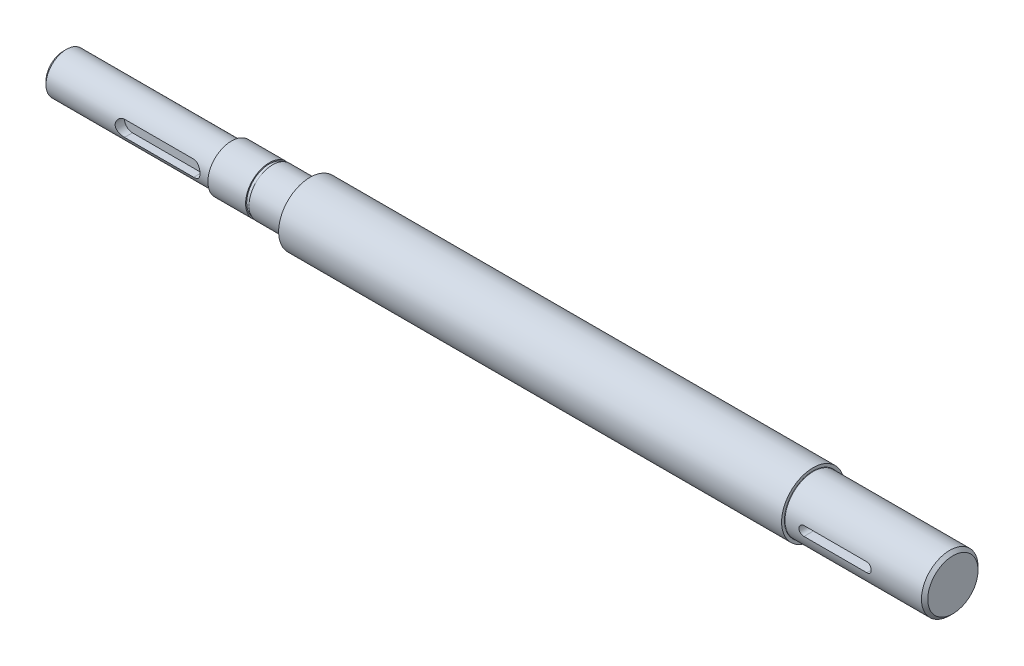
ISO-10303-21;
HEADER;
FILE_DESCRIPTION(('STEP AP214'),'2;1');
FILE_NAME('part.step','',(''),(''),'','','');
FILE_SCHEMA(('AUTOMOTIVE_DESIGN { 1 0 10303 214 1 1 1 1 }'));
ENDSEC;
DATA;
#1=APPLICATION_CONTEXT('core data for automotive mechanical design processes');
#2=APPLICATION_PROTOCOL_DEFINITION('international standard','automotive_design',2000,#1);
#3=PRODUCT_CONTEXT('',#1,'mechanical');
#4=PRODUCT('Part','Part','',(#3));
#5=PRODUCT_RELATED_PRODUCT_CATEGORY('part','',(#4));
#6=PRODUCT_DEFINITION_FORMATION('','',#4);
#7=PRODUCT_DEFINITION_CONTEXT('part definition',#1,'design');
#8=PRODUCT_DEFINITION('design','',#6,#7);
#9=PRODUCT_DEFINITION_SHAPE('','',#8);
#10=(LENGTH_UNIT() NAMED_UNIT(*) SI_UNIT(.MILLI.,.METRE.));
#11=(NAMED_UNIT(*) PLANE_ANGLE_UNIT() SI_UNIT($,.RADIAN.));
#12=(NAMED_UNIT(*) SI_UNIT($,.STERADIAN.) SOLID_ANGLE_UNIT());
#13=UNCERTAINTY_MEASURE_WITH_UNIT(LENGTH_MEASURE(1.E-05),#10,'distance_accuracy_value','');
#14=(GEOMETRIC_REPRESENTATION_CONTEXT(3) GLOBAL_UNCERTAINTY_ASSIGNED_CONTEXT((#13)) GLOBAL_UNIT_ASSIGNED_CONTEXT((#10,
#11,#12)) REPRESENTATION_CONTEXT('',''));
#15=CARTESIAN_POINT('',(0.,0.,0.));
#16=DIRECTION('',(0.,0.,1.));
#17=DIRECTION('',(1.,0.,0.));
#18=AXIS2_PLACEMENT_3D('',#15,#16,#17);
#19=CARTESIAN_POINT('',(0.,0.,0.));
#20=DIRECTION('',(1.,0.,0.));
#21=DIRECTION('',(0.,0.,-1.));
#22=AXIS2_PLACEMENT_3D('',#19,#20,#21);
#23=PLANE('',#22);
#24=CARTESIAN_POINT('',(0.,0.,0.));
#25=DIRECTION('',(1.,0.,0.));
#26=DIRECTION('',(0.,0.,-1.));
#27=AXIS2_PLACEMENT_3D('',#24,#25,#26);
#28=CIRCLE('',#27,5.50000000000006);
#29=CARTESIAN_POINT('',(0.,0.,-5.50000000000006));
#30=VERTEX_POINT('',#29);
#31=EDGE_CURVE('E436',#30,#30,#28,.F.);
#32=ORIENTED_EDGE('',*,*,#31,.T.);
#33=EDGE_LOOP('',(#32));
#34=FACE_BOUND('',#33,.T.);
#35=ADVANCED_FACE('F34',(#34),#23,.F.);
#36=CARTESIAN_POINT('',(0.,0.,0.));
#37=DIRECTION('',(-1.,0.,0.));
#38=DIRECTION('',(0.,0.,1.));
#39=AXIS2_PLACEMENT_3D('',#36,#37,#38);
#40=CYLINDRICAL_SURFACE('',#39,6.5);
#41=CARTESIAN_POINT('',(53.4,0.,0.));
#42=DIRECTION('',(1.,0.,0.));
#43=DIRECTION('',(0.,0.,-1.));
#44=AXIS2_PLACEMENT_3D('',#41,#42,#43);
#45=CIRCLE('',#44,6.5);
#46=CARTESIAN_POINT('',(53.4,0.,-6.5));
#47=VERTEX_POINT('',#46);
#48=EDGE_CURVE('E42',#47,#47,#45,.F.);
#49=ORIENTED_EDGE('',*,*,#48,.T.);
#50=EDGE_LOOP('',(#49));
#51=FACE_BOUND('',#50,.T.);
#52=CARTESIAN_POINT('',(0.999999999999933,0.,0.));
#53=DIRECTION('',(1.,0.,0.));
#54=DIRECTION('',(0.,0.,-1.));
#55=AXIS2_PLACEMENT_3D('',#52,#53,#54);
#56=CIRCLE('',#55,6.5);
#57=CARTESIAN_POINT('',(0.999999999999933,0.,-6.5));
#58=VERTEX_POINT('',#57);
#59=EDGE_CURVE('E296',#58,#58,#56,.T.);
#60=ORIENTED_EDGE('',*,*,#59,.T.);
#61=EDGE_LOOP('',(#60));
#62=FACE_BOUND('',#61,.T.);
#63=DIRECTION('',(-1.,0.,0.));
#64=VECTOR('',#63,1.);
#65=CARTESIAN_POINT('',(0.,-2.5,6.));
#66=LINE('',#65,#64);
#67=CARTESIAN_POINT('',(47.5,-2.5,6.));
#68=VERTEX_POINT('',#67);
#69=CARTESIAN_POINT('',(25.5,-2.5,6.));
#70=VERTEX_POINT('',#69);
#71=EDGE_CURVE('E179',#68,#70,#66,.T.);
#72=ORIENTED_EDGE('',*,*,#71,.T.);
#73=CARTESIAN_POINT('',(25.5,-2.5,6.));
#74=CARTESIAN_POINT('',(25.4325068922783,-2.5000097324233,5.99998690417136));
#75=CARTESIAN_POINT('',(25.3650209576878,-2.49726705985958,6.00113851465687));
#76=CARTESIAN_POINT('',(25.2305881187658,-2.48635290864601,6.00567338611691));
#77=CARTESIAN_POINT('',(25.1636410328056,-2.47818334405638,6.0090558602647));
#78=CARTESIAN_POINT('',(25.0310073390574,-2.45653131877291,6.01793841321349));
#79=CARTESIAN_POINT('',(24.965316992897,-2.44306856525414,6.02343063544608));
#80=CARTESIAN_POINT('',(24.8354200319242,-2.41097802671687,6.03634679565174));
#81=CARTESIAN_POINT('',(24.7712134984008,-2.39234995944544,6.04377083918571));
#82=CARTESIAN_POINT('',(24.5815925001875,-2.32899932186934,6.06859455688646));
#83=CARTESIAN_POINT('',(24.4589297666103,-2.27676942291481,6.08856367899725));
#84=CARTESIAN_POINT('',(24.2240633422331,-2.15397308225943,6.13307781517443));
#85=CARTESIAN_POINT('',(24.1118688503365,-2.08339071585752,6.15762679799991));
#86=CARTESIAN_POINT('',(23.8952626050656,-1.92195266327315,6.20996142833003));
#87=CARTESIAN_POINT('',(23.7914706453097,-1.83029547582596,6.23784527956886));
#88=CARTESIAN_POINT('',(23.6002963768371,-1.63101277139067,6.29289074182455));
#89=CARTESIAN_POINT('',(23.5129173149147,-1.52338410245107,6.32005220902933));
#90=CARTESIAN_POINT('',(23.3539853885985,-1.29042661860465,6.37177529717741));
#91=CARTESIAN_POINT('',(23.2831174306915,-1.16459922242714,6.39620772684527));
#92=CARTESIAN_POINT('',(23.1638189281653,-0.90170460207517,6.43852594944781));
#93=CARTESIAN_POINT('',(23.1153796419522,-0.764641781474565,6.45641429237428));
#94=CARTESIAN_POINT('',(23.0445173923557,-0.489729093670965,6.48292860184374));
#95=CARTESIAN_POINT('',(23.0210187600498,-0.352194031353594,6.49193621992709));
#96=CARTESIAN_POINT('',(22.9972517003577,-0.0748549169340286,6.50104762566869));
#97=CARTESIAN_POINT('',(22.9969757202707,0.0649483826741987,6.50115430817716));
#98=CARTESIAN_POINT('',(23.0190501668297,0.335117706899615,6.49269024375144));
#99=CARTESIAN_POINT('',(23.0402247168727,0.46559643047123,6.48457045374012));
#100=CARTESIAN_POINT('',(23.1026123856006,0.720982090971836,6.46116364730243));
#101=CARTESIAN_POINT('',(23.1438266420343,0.845888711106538,6.4458762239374));
#102=CARTESIAN_POINT('',(23.2456375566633,1.08878530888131,6.4093577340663));
#103=CARTESIAN_POINT('',(23.3065118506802,1.20664567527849,6.38804210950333));
#104=CARTESIAN_POINT('',(23.4456647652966,1.43077664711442,6.34160845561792));
#105=CARTESIAN_POINT('',(23.523949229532,1.5370433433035,6.31648915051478));
#106=CARTESIAN_POINT('',(23.7012897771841,1.74186560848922,6.26320862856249));
#107=CARTESIAN_POINT('',(23.8013234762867,1.83955197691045,6.23495532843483));
#108=CARTESIAN_POINT('',(24.016520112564,2.01711505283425,6.17979877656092));
#109=CARTESIAN_POINT('',(24.1316892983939,2.09698436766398,6.15289608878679));
#110=CARTESIAN_POINT('',(24.3775178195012,2.23844676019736,6.102879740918));
#111=CARTESIAN_POINT('',(24.5084915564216,2.29953500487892,6.07987716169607));
#112=CARTESIAN_POINT('',(24.7799191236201,2.39838605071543,6.04157232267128));
#113=CARTESIAN_POINT('',(24.92035626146,2.43618878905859,6.02625688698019));
#114=CARTESIAN_POINT('',(25.1351897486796,2.4743245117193,6.01064806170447));
#115=CARTESIAN_POINT('',(25.207784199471,2.48394241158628,6.00667159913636));
#116=CARTESIAN_POINT('',(25.3535711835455,2.49677951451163,6.00134277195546));
#117=CARTESIAN_POINT('',(25.4267631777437,2.50000395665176,5.99998825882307));
#118=CARTESIAN_POINT('',(25.5,2.5,6.));
#119=B_SPLINE_CURVE_WITH_KNOTS('',3,(#73,#74,#75,#76,#77,#78,#79,#80,#81,#82,#83,#84,#85,#86,
#87,#88,#89,#90,#91,#92,#93,#94,#95,#96,#97,#98,#99,#100,#101,#102,#103,#104,#105,#106,#107,
#108,#109,#110,#111,#112,#113,#114,#115,#116,#117,#118),.UNSPECIFIED.,.F.,.F.,(4,2,2,2,2,2,2,2,
2,2,2,2,2,2,2,2,2,2,2,2,2,2,4),(0.,0.202401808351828,0.404732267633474,0.606316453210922,
0.807911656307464,1.21035890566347,1.61315653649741,2.0350209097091,2.45696864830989,
2.89414312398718,3.33114706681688,3.74842479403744,4.16556680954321,4.56101652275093,
4.95648869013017,5.35780957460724,5.75926536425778,6.18527598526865,6.6114630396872,
7.04826665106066,7.48431899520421,7.70403971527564,7.92358031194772),.UNSPECIFIED.);
#120=CARTESIAN_POINT('',(25.5,2.5,6.));
#121=VERTEX_POINT('',#120);
#122=EDGE_CURVE('E215',#70,#121,#119,.T.);
#123=ORIENTED_EDGE('',*,*,#122,.T.);
#124=DIRECTION('',(-1.,0.,0.));
#125=VECTOR('',#124,1.);
#126=CARTESIAN_POINT('',(0.,2.5,6.));
#127=LINE('',#126,#125);
#128=CARTESIAN_POINT('',(47.5,2.5,6.));
#129=VERTEX_POINT('',#128);
#130=EDGE_CURVE('E190',#121,#129,#127,.F.);
#131=ORIENTED_EDGE('',*,*,#130,.T.);
#132=CARTESIAN_POINT('',(47.5,2.5,6.));
#133=CARTESIAN_POINT('',(47.5674931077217,2.5000097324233,5.99998690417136));
#134=CARTESIAN_POINT('',(47.6349790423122,2.49726705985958,6.00113851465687));
#135=CARTESIAN_POINT('',(47.7694118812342,2.48635290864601,6.00567338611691));
#136=CARTESIAN_POINT('',(47.8363589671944,2.47818334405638,6.0090558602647));
#137=CARTESIAN_POINT('',(47.9689926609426,2.45653131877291,6.01793841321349));
#138=CARTESIAN_POINT('',(48.034683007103,2.44306856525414,6.02343063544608));
#139=CARTESIAN_POINT('',(48.1645799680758,2.41097802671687,6.03634679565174));
#140=CARTESIAN_POINT('',(48.2287865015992,2.39234995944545,6.04377083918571));
#141=CARTESIAN_POINT('',(48.4184074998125,2.32899932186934,6.06859455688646));
#142=CARTESIAN_POINT('',(48.5410702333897,2.27676942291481,6.08856367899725));
#143=CARTESIAN_POINT('',(48.7759366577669,2.15397308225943,6.13307781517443));
#144=CARTESIAN_POINT('',(48.8881311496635,2.08339071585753,6.15762679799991));
#145=CARTESIAN_POINT('',(49.1047373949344,1.92195266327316,6.20996142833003));
#146=CARTESIAN_POINT('',(49.2085293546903,1.83029547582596,6.23784527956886));
#147=CARTESIAN_POINT('',(49.3997036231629,1.63101277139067,6.29289074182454));
#148=CARTESIAN_POINT('',(49.4870826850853,1.52338410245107,6.32005220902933));
#149=CARTESIAN_POINT('',(49.6460146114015,1.29042661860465,6.37177529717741));
#150=CARTESIAN_POINT('',(49.7168825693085,1.16459922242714,6.39620772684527));
#151=CARTESIAN_POINT('',(49.8361810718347,0.901704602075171,6.43852594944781));
#152=CARTESIAN_POINT('',(49.8846203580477,0.764641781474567,6.45641429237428));
#153=CARTESIAN_POINT('',(49.9554826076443,0.489729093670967,6.48292860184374));
#154=CARTESIAN_POINT('',(49.9789812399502,0.352194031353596,6.49193621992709));
#155=CARTESIAN_POINT('',(50.0027482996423,0.0748549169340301,6.50104762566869));
#156=CARTESIAN_POINT('',(50.0030242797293,-0.0649483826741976,6.50115430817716));
#157=CARTESIAN_POINT('',(49.9809498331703,-0.335117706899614,6.49269024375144));
#158=CARTESIAN_POINT('',(49.9597752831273,-0.465596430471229,6.48457045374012));
#159=CARTESIAN_POINT('',(49.8973876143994,-0.720982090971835,6.46116364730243));
#160=CARTESIAN_POINT('',(49.8561733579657,-0.845888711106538,6.4458762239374));
#161=CARTESIAN_POINT('',(49.7543624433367,-1.08878530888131,6.4093577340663));
#162=CARTESIAN_POINT('',(49.6934881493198,-1.20664567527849,6.38804210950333));
#163=CARTESIAN_POINT('',(49.5543352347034,-1.43077664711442,6.34160845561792));
#164=CARTESIAN_POINT('',(49.476050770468,-1.5370433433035,6.31648915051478));
#165=CARTESIAN_POINT('',(49.2987102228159,-1.74186560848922,6.26320862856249));
#166=CARTESIAN_POINT('',(49.1986765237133,-1.83955197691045,6.23495532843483));
#167=CARTESIAN_POINT('',(48.983479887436,-2.01711505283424,6.17979877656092));
#168=CARTESIAN_POINT('',(48.8683107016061,-2.09698436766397,6.15289608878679));
#169=CARTESIAN_POINT('',(48.6224821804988,-2.23844676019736,6.102879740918));
#170=CARTESIAN_POINT('',(48.4915084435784,-2.29953500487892,6.07987716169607));
#171=CARTESIAN_POINT('',(48.22008087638,-2.39838605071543,6.04157232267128));
#172=CARTESIAN_POINT('',(48.07964373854,-2.43618878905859,6.02625688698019));
#173=CARTESIAN_POINT('',(47.8648102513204,-2.4743245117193,6.01064806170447));
#174=CARTESIAN_POINT('',(47.792215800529,-2.48394241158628,6.00667159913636));
#175=CARTESIAN_POINT('',(47.6464288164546,-2.49677951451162,6.00134277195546));
#176=CARTESIAN_POINT('',(47.5732368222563,-2.50000395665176,5.99998825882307));
#177=CARTESIAN_POINT('',(47.5,-2.5,6.));
#178=B_SPLINE_CURVE_WITH_KNOTS('',3,(#132,#133,#134,#135,#136,#137,#138,#139,#140,#141,#142,
#143,#144,#145,#146,#147,#148,#149,#150,#151,#152,#153,#154,#155,#156,#157,#158,#159,#160,#161,
#162,#163,#164,#165,#166,#167,#168,#169,#170,#171,#172,#173,#174,#175,#176,#177),.UNSPECIFIED.,
.F.,.F.,(4,2,2,2,2,2,2,2,2,2,2,2,2,2,2,2,2,2,2,2,2,2,4),(0.,0.202401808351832,0.404732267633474,
0.606316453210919,0.807911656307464,1.21035890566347,1.61315653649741,2.0350209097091,
2.45696864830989,2.89414312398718,3.33114706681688,3.74842479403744,4.16556680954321,
4.56101652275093,4.95648869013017,5.35780957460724,5.75926536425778,6.18527598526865,
6.61146303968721,7.04826665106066,7.4843189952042,7.70403971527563,7.92358031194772),.UNSPECIFIED.);
#179=EDGE_CURVE('E182',#129,#68,#178,.T.);
#180=ORIENTED_EDGE('',*,*,#179,.T.);
#181=EDGE_LOOP('',(#72,#123,#131,#180));
#182=FACE_BOUND('',#181,.T.);
#183=ADVANCED_FACE('F192',(#51,#62,#182),#40,.T.);
#184=CARTESIAN_POINT('',(53.5,6.5,0.));
#185=DIRECTION('',(1.,0.,0.));
#186=DIRECTION('',(0.,0.,-1.));
#187=AXIS2_PLACEMENT_3D('',#184,#185,#186);
#188=PLANE('',#187);
#189=CARTESIAN_POINT('',(53.5,0.,0.));
#190=DIRECTION('',(1.,0.,0.));
#191=DIRECTION('',(0.,0.,-1.));
#192=AXIS2_PLACEMENT_3D('',#189,#190,#191);
#193=CIRCLE('',#192,6.6);
#194=CARTESIAN_POINT('',(53.5,0.,-6.6));
#195=VERTEX_POINT('',#194);
#196=EDGE_CURVE('E11',#195,#195,#193,.T.);
#197=ORIENTED_EDGE('',*,*,#196,.T.);
#198=EDGE_LOOP('',(#197));
#199=FACE_BOUND('',#198,.T.);
#200=CARTESIAN_POINT('',(53.5,0.,0.));
#201=DIRECTION('',(-1.,0.,0.));
#202=DIRECTION('',(0.,0.,1.));
#203=AXIS2_PLACEMENT_3D('',#200,#201,#202);
#204=CIRCLE('',#203,7.5);
#205=CARTESIAN_POINT('',(53.5,0.,7.5));
#206=VERTEX_POINT('',#205);
#207=EDGE_CURVE('E176',#206,#206,#204,.T.);
#208=ORIENTED_EDGE('',*,*,#207,.T.);
#209=EDGE_LOOP('',(#208));
#210=FACE_BOUND('',#209,.T.);
#211=ADVANCED_FACE('F256',(#199,#210),#188,.F.);
#212=CARTESIAN_POINT('',(0.,0.,0.));
#213=DIRECTION('',(-1.,0.,0.));
#214=DIRECTION('',(0.,0.,1.));
#215=AXIS2_PLACEMENT_3D('',#212,#213,#214);
#216=CYLINDRICAL_SURFACE('',#215,7.5);
#217=ORIENTED_EDGE('',*,*,#207,.F.);
#218=EDGE_LOOP('',(#217));
#219=FACE_BOUND('',#218,.T.);
#220=CARTESIAN_POINT('',(65.5,0.,0.));
#221=DIRECTION('',(-1.,0.,0.));
#222=DIRECTION('',(0.,0.,1.));
#223=AXIS2_PLACEMENT_3D('',#220,#221,#222);
#224=CIRCLE('',#223,7.5);
#225=CARTESIAN_POINT('',(65.5,0.,7.5));
#226=VERTEX_POINT('',#225);
#227=EDGE_CURVE('E173',#226,#226,#224,.T.);
#228=ORIENTED_EDGE('',*,*,#227,.T.);
#229=EDGE_LOOP('',(#228));
#230=FACE_BOUND('',#229,.T.);
#231=ADVANCED_FACE('F397',(#219,#230),#216,.T.);
#232=CARTESIAN_POINT('',(65.5,7.5,0.));
#233=DIRECTION('',(-1.,0.,0.));
#234=DIRECTION('',(0.,0.,1.));
#235=AXIS2_PLACEMENT_3D('',#232,#233,#234);
#236=PLANE('',#235);
#237=ORIENTED_EDGE('',*,*,#227,.F.);
#238=EDGE_LOOP('',(#237));
#239=FACE_BOUND('',#238,.T.);
#240=CARTESIAN_POINT('',(65.5,0.,0.));
#241=DIRECTION('',(-1.,0.,0.));
#242=DIRECTION('',(0.,0.,1.));
#243=AXIS2_PLACEMENT_3D('',#240,#241,#242);
#244=CIRCLE('',#243,7.15);
#245=CARTESIAN_POINT('',(65.5,0.,7.15));
#246=VERTEX_POINT('',#245);
#247=EDGE_CURVE('E170',#246,#246,#244,.T.);
#248=ORIENTED_EDGE('',*,*,#247,.T.);
#249=EDGE_LOOP('',(#248));
#250=FACE_BOUND('',#249,.T.);
#251=ADVANCED_FACE('F486',(#239,#250),#236,.F.);
#252=CARTESIAN_POINT('',(0.,0.,0.));
#253=DIRECTION('',(-1.,0.,0.));
#254=DIRECTION('',(0.,0.,1.));
#255=AXIS2_PLACEMENT_3D('',#252,#253,#254);
#256=CYLINDRICAL_SURFACE('',#255,7.15);
#257=ORIENTED_EDGE('',*,*,#247,.F.);
#258=EDGE_LOOP('',(#257));
#259=FACE_BOUND('',#258,.T.);
#260=CARTESIAN_POINT('',(66.6,0.,0.));
#261=DIRECTION('',(-1.,0.,0.));
#262=DIRECTION('',(0.,0.,1.));
#263=AXIS2_PLACEMENT_3D('',#260,#261,#262);
#264=CIRCLE('',#263,7.15);
#265=CARTESIAN_POINT('',(66.6,0.,7.15));
#266=VERTEX_POINT('',#265);
#267=EDGE_CURVE('E167',#266,#266,#264,.T.);
#268=ORIENTED_EDGE('',*,*,#267,.T.);
#269=EDGE_LOOP('',(#268));
#270=FACE_BOUND('',#269,.T.);
#271=ADVANCED_FACE('F478',(#259,#270),#256,.T.);
#272=CARTESIAN_POINT('',(66.6,7.15,0.));
#273=DIRECTION('',(1.,0.,0.));
#274=DIRECTION('',(0.,0.,-1.));
#275=AXIS2_PLACEMENT_3D('',#272,#273,#274);
#276=PLANE('',#275);
#277=ORIENTED_EDGE('',*,*,#267,.F.);
#278=EDGE_LOOP('',(#277));
#279=FACE_BOUND('',#278,.T.);
#280=CARTESIAN_POINT('',(66.6,0.,0.));
#281=DIRECTION('',(-1.,0.,0.));
#282=DIRECTION('',(0.,0.,1.));
#283=AXIS2_PLACEMENT_3D('',#280,#281,#282);
#284=CIRCLE('',#283,7.5);
#285=CARTESIAN_POINT('',(66.6,0.,7.5));
#286=VERTEX_POINT('',#285);
#287=EDGE_CURVE('E164',#286,#286,#284,.T.);
#288=ORIENTED_EDGE('',*,*,#287,.T.);
#289=EDGE_LOOP('',(#288));
#290=FACE_BOUND('',#289,.T.);
#291=ADVANCED_FACE('F470',(#279,#290),#276,.F.);
#292=CARTESIAN_POINT('',(0.,0.,0.));
#293=DIRECTION('',(-1.,0.,0.));
#294=DIRECTION('',(0.,0.,1.));
#295=AXIS2_PLACEMENT_3D('',#292,#293,#294);
#296=CYLINDRICAL_SURFACE('',#295,7.5);
#297=ORIENTED_EDGE('',*,*,#287,.F.);
#298=EDGE_LOOP('',(#297));
#299=FACE_BOUND('',#298,.T.);
#300=CARTESIAN_POINT('',(78.1,0.,0.));
#301=DIRECTION('',(-1.,0.,0.));
#302=DIRECTION('',(0.,0.,1.));
#303=AXIS2_PLACEMENT_3D('',#300,#301,#302);
#304=CIRCLE('',#303,7.5);
#305=CARTESIAN_POINT('',(78.1,0.,7.5));
#306=VERTEX_POINT('',#305);
#307=EDGE_CURVE('E161',#306,#306,#304,.T.);
#308=ORIENTED_EDGE('',*,*,#307,.T.);
#309=EDGE_LOOP('',(#308));
#310=FACE_BOUND('',#309,.T.);
#311=ADVANCED_FACE('F462',(#299,#310),#296,.T.);
#312=CARTESIAN_POINT('',(78.1,0.,0.));
#313=DIRECTION('',(-1.,0.,0.));
#314=DIRECTION('',(0.,0.,1.));
#315=AXIS2_PLACEMENT_3D('',#312,#313,#314);
#316=TOROIDAL_SURFACE('',#315,7.9,0.399999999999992);
#317=ORIENTED_EDGE('',*,*,#307,.F.);
#318=EDGE_LOOP('',(#317));
#319=FACE_BOUND('',#318,.T.);
#320=CARTESIAN_POINT('',(78.5,0.,0.));
#321=DIRECTION('',(-1.,0.,0.));
#322=DIRECTION('',(0.,0.,1.));
#323=AXIS2_PLACEMENT_3D('',#320,#321,#322);
#324=CIRCLE('',#323,7.9);
#325=CARTESIAN_POINT('',(78.5,0.,7.9));
#326=VERTEX_POINT('',#325);
#327=EDGE_CURVE('E158',#326,#326,#324,.T.);
#328=ORIENTED_EDGE('',*,*,#327,.T.);
#329=EDGE_LOOP('',(#328));
#330=FACE_BOUND('',#329,.T.);
#331=ADVANCED_FACE('F454',(#319,#330),#316,.F.);
#332=CARTESIAN_POINT('',(78.5,7.9,0.));
#333=DIRECTION('',(1.,0.,0.));
#334=DIRECTION('',(0.,0.,-1.));
#335=AXIS2_PLACEMENT_3D('',#332,#333,#334);
#336=PLANE('',#335);
#337=ORIENTED_EDGE('',*,*,#327,.F.);
#338=EDGE_LOOP('',(#337));
#339=FACE_BOUND('',#338,.T.);
#340=CARTESIAN_POINT('',(78.5,0.,0.));
#341=DIRECTION('',(-1.,0.,0.));
#342=DIRECTION('',(0.,0.,1.));
#343=AXIS2_PLACEMENT_3D('',#340,#341,#342);
#344=CIRCLE('',#343,10.);
#345=CARTESIAN_POINT('',(78.5,0.,10.));
#346=VERTEX_POINT('',#345);
#347=EDGE_CURVE('E155',#346,#346,#344,.T.);
#348=ORIENTED_EDGE('',*,*,#347,.T.);
#349=EDGE_LOOP('',(#348));
#350=FACE_BOUND('',#349,.T.);
#351=ADVANCED_FACE('F447',(#339,#350),#336,.F.);
#352=CARTESIAN_POINT('',(0.,0.,0.));
#353=DIRECTION('',(-1.,0.,0.));
#354=DIRECTION('',(0.,0.,1.));
#355=AXIS2_PLACEMENT_3D('',#352,#353,#354);
#356=CYLINDRICAL_SURFACE('',#355,10.);
#357=ORIENTED_EDGE('',*,*,#347,.F.);
#358=EDGE_LOOP('',(#357));
#359=FACE_BOUND('',#358,.T.);
#360=CARTESIAN_POINT('',(238.5,0.,0.));
#361=DIRECTION('',(-1.,0.,0.));
#362=DIRECTION('',(0.,0.,1.));
#363=AXIS2_PLACEMENT_3D('',#360,#361,#362);
#364=CIRCLE('',#363,10.);
#365=CARTESIAN_POINT('',(238.5,0.,10.));
#366=VERTEX_POINT('',#365);
#367=EDGE_CURVE('E145',#366,#366,#364,.T.);
#368=ORIENTED_EDGE('',*,*,#367,.T.);
#369=EDGE_LOOP('',(#368));
#370=FACE_BOUND('',#369,.T.);
#371=ADVANCED_FACE('F409',(#359,#370),#356,.T.);
#372=CARTESIAN_POINT('',(238.5,10.,0.));
#373=DIRECTION('',(-1.,0.,0.));
#374=DIRECTION('',(0.,0.,1.));
#375=AXIS2_PLACEMENT_3D('',#372,#373,#374);
#376=PLANE('',#375);
#377=CARTESIAN_POINT('',(238.5,0.,0.));
#378=DIRECTION('',(-1.,0.,0.));
#379=DIRECTION('',(0.,0.,1.));
#380=AXIS2_PLACEMENT_3D('',#377,#378,#379);
#381=CIRCLE('',#380,9.1);
#382=CARTESIAN_POINT('',(238.5,0.,9.1));
#383=VERTEX_POINT('',#382);
#384=EDGE_CURVE('E280',#383,#383,#381,.T.);
#385=ORIENTED_EDGE('',*,*,#384,.T.);
#386=EDGE_LOOP('',(#385));
#387=FACE_BOUND('',#386,.T.);
#388=ORIENTED_EDGE('',*,*,#367,.F.);
#389=EDGE_LOOP('',(#388));
#390=FACE_BOUND('',#389,.T.);
#391=ADVANCED_FACE('F404',(#387,#390),#376,.F.);
#392=CARTESIAN_POINT('',(0.,0.,0.));
#393=DIRECTION('',(-1.,0.,0.));
#394=DIRECTION('',(0.,0.,1.));
#395=AXIS2_PLACEMENT_3D('',#392,#393,#394);
#396=CYLINDRICAL_SURFACE('',#395,9.);
#397=CARTESIAN_POINT('',(238.6,0.,0.));
#398=DIRECTION('',(-1.,0.,0.));
#399=DIRECTION('',(0.,0.,1.));
#400=AXIS2_PLACEMENT_3D('',#397,#398,#399);
#401=CIRCLE('',#400,9.);
#402=CARTESIAN_POINT('',(238.6,0.,9.));
#403=VERTEX_POINT('',#402);
#404=EDGE_CURVE('E277',#403,#403,#401,.F.);
#405=ORIENTED_EDGE('',*,*,#404,.T.);
#406=EDGE_LOOP('',(#405));
#407=FACE_BOUND('',#406,.T.);
#408=CARTESIAN_POINT('',(282.,0.,0.));
#409=DIRECTION('',(-1.,0.,0.));
#410=DIRECTION('',(0.,0.,1.));
#411=AXIS2_PLACEMENT_3D('',#408,#409,#410);
#412=CIRCLE('',#411,9.);
#413=CARTESIAN_POINT('',(282.,0.,9.));
#414=VERTEX_POINT('',#413);
#415=EDGE_CURVE('E286',#414,#414,#412,.T.);
#416=ORIENTED_EDGE('',*,*,#415,.T.);
#417=EDGE_LOOP('',(#416));
#418=FACE_BOUND('',#417,.T.);
#419=DIRECTION('',(-1.,0.,0.));
#420=VECTOR('',#419,1.);
#421=CARTESIAN_POINT('',(0.,1.5,8.87411967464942));
#422=LINE('',#421,#420);
#423=CARTESIAN_POINT('',(244.5,1.5,8.87411967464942));
#424=VERTEX_POINT('',#423);
#425=CARTESIAN_POINT('',(264.5,1.5,8.87411967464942));
#426=VERTEX_POINT('',#425);
#427=EDGE_CURVE('E435',#424,#426,#422,.F.);
#428=ORIENTED_EDGE('',*,*,#427,.T.);
#429=CARTESIAN_POINT('',(264.5,1.5,8.87411967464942));
#430=CARTESIAN_POINT('',(264.541888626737,1.50000006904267,8.87411792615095));
#431=CARTESIAN_POINT('',(264.583756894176,1.49824423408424,8.87441664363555));
#432=CARTESIAN_POINT('',(264.667188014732,1.49124178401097,8.87559669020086));
#433=CARTESIAN_POINT('',(264.708750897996,1.48599551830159,8.8764779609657));
#434=CARTESIAN_POINT('',(264.832418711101,1.4650822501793,8.87996319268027));
#435=CARTESIAN_POINT('',(264.913686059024,1.44424056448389,8.88340872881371));
#436=CARTESIAN_POINT('',(265.071504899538,1.38937881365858,8.89215318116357));
#437=CARTESIAN_POINT('',(265.148055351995,1.35535585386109,8.89745250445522));
#438=CARTESIAN_POINT('',(265.294375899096,1.27511788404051,8.90930486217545));
#439=CARTESIAN_POINT('',(265.364145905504,1.22890271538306,8.91585791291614));
#440=CARTESIAN_POINT('',(265.495585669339,1.12511491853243,8.92955048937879));
#441=CARTESIAN_POINT('',(265.55717956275,1.06744685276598,8.93669462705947));
#442=CARTESIAN_POINT('',(265.669870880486,0.942589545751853,8.95072423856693));
#443=CARTESIAN_POINT('',(265.720966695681,0.875398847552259,8.95760967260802));
#444=CARTESIAN_POINT('',(265.811490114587,0.732911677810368,8.97039460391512));
#445=CARTESIAN_POINT('',(265.850846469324,0.657569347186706,8.97628798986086));
#446=CARTESIAN_POINT('',(265.916314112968,0.501232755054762,8.98637266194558));
#447=CARTESIAN_POINT('',(265.942427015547,0.420239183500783,8.99056415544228));
#448=CARTESIAN_POINT('',(265.980435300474,0.255687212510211,8.99674037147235));
#449=CARTESIAN_POINT('',(265.992459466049,0.172159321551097,8.99874507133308));
#450=CARTESIAN_POINT('',(266.002349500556,0.00424717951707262,9.00039048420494));
#451=CARTESIAN_POINT('',(266.000215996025,-0.0801370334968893,9.00003130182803));
#452=CARTESIAN_POINT('',(265.981951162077,-0.246481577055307,8.99700514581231));
#453=CARTESIAN_POINT('',(265.965958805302,-0.328457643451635,8.99436108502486));
#454=CARTESIAN_POINT('',(265.920649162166,-0.488545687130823,8.98708784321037));
#455=CARTESIAN_POINT('',(265.891331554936,-0.566657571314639,8.98245861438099));
#456=CARTESIAN_POINT('',(265.82006497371,-0.717215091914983,8.97169609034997));
#457=CARTESIAN_POINT('',(265.778058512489,-0.789633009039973,8.96555597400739));
#458=CARTESIAN_POINT('',(265.682650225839,-0.926441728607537,8.95245416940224));
#459=CARTESIAN_POINT('',(265.629247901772,-0.990832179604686,8.94549244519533));
#460=CARTESIAN_POINT('',(265.511801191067,-1.11057444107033,8.93142258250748));
#461=CARTESIAN_POINT('',(265.447636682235,-1.16580839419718,8.92431368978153));
#462=CARTESIAN_POINT('',(265.3108666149,-1.26476070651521,8.91082953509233));
#463=CARTESIAN_POINT('',(265.238258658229,-1.30847578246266,8.90445448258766));
#464=CARTESIAN_POINT('',(265.086515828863,-1.38317289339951,8.89315848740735));
#465=CARTESIAN_POINT('',(265.007370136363,-1.41413329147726,8.88824001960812));
#466=CARTESIAN_POINT('',(264.844955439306,-1.46224310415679,8.88045320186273));
#467=CARTESIAN_POINT('',(264.76169279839,-1.47941316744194,8.87758178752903));
#468=CARTESIAN_POINT('',(264.648164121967,-1.49296191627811,8.87530681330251));
#469=CARTESIAN_POINT('',(264.618568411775,-1.49560229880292,8.87486203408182));
#470=CARTESIAN_POINT('',(264.559319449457,-1.49911904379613,8.87426876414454));
#471=CARTESIAN_POINT('',(264.529666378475,-1.49999837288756,8.87411977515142));
#472=CARTESIAN_POINT('',(264.5,-1.5,8.87411967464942));
#473=B_SPLINE_CURVE_WITH_KNOTS('',3,(#429,#430,#431,#432,#433,#434,#435,#436,#437,#438,#439,
#440,#441,#442,#443,#444,#445,#446,#447,#448,#449,#450,#451,#452,#453,#454,#455,#456,#457,#458,
#459,#460,#461,#462,#463,#464,#465,#466,#467,#468,#469,#470,#471,#472),.UNSPECIFIED.,.F.,.F.,(4,
2,2,2,2,2,2,2,2,2,2,2,2,2,2,2,2,2,2,2,2,4),(0.,0.125587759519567,0.251162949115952,
0.501770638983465,0.752433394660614,1.00309941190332,1.25594920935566,1.50883773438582,
1.76323123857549,2.01759373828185,2.26961254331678,2.52162019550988,2.77112965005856,
3.02064511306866,3.2713084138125,3.52198268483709,3.775667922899,4.02942539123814,
4.28361157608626,4.53741644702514,4.62652585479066,4.71548502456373),.UNSPECIFIED.);
#474=CARTESIAN_POINT('',(264.5,-1.5,8.87411967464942));
#475=VERTEX_POINT('',#474);
#476=EDGE_CURVE('E221',#426,#475,#473,.T.);
#477=ORIENTED_EDGE('',*,*,#476,.T.);
#478=DIRECTION('',(-1.,0.,0.));
#479=VECTOR('',#478,1.);
#480=CARTESIAN_POINT('',(0.,-1.5,8.87411967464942));
#481=LINE('',#480,#479);
#482=CARTESIAN_POINT('',(244.5,-1.5,8.87411967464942));
#483=VERTEX_POINT('',#482);
#484=EDGE_CURVE('E437',#475,#483,#481,.T.);
#485=ORIENTED_EDGE('',*,*,#484,.T.);
#486=CARTESIAN_POINT('',(244.5,-1.5,8.87411967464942));
#487=CARTESIAN_POINT('',(244.458111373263,-1.50000006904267,8.87411792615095));
#488=CARTESIAN_POINT('',(244.416243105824,-1.49824423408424,8.87441664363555));
#489=CARTESIAN_POINT('',(244.332811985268,-1.49124178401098,8.87559669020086));
#490=CARTESIAN_POINT('',(244.291249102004,-1.4859955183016,8.8764779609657));
#491=CARTESIAN_POINT('',(244.167581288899,-1.46508225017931,8.87996319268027));
#492=CARTESIAN_POINT('',(244.086313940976,-1.4442405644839,8.88340872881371));
#493=CARTESIAN_POINT('',(243.928495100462,-1.38937881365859,8.89215318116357));
#494=CARTESIAN_POINT('',(243.851944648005,-1.35535585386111,8.89745250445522));
#495=CARTESIAN_POINT('',(243.705624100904,-1.27511788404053,8.90930486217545));
#496=CARTESIAN_POINT('',(243.635854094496,-1.22890271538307,8.91585791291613));
#497=CARTESIAN_POINT('',(243.504414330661,-1.12511491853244,8.92955048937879));
#498=CARTESIAN_POINT('',(243.44282043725,-1.06744685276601,8.93669462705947));
#499=CARTESIAN_POINT('',(243.330129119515,-0.942589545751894,8.95072423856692));
#500=CARTESIAN_POINT('',(243.279033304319,-0.8753988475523,8.95760967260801));
#501=CARTESIAN_POINT('',(243.188509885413,-0.732911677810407,8.97039460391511));
#502=CARTESIAN_POINT('',(243.149153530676,-0.657569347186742,8.97628798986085));
#503=CARTESIAN_POINT('',(243.083685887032,-0.501232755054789,8.98637266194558));
#504=CARTESIAN_POINT('',(243.057572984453,-0.420239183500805,8.99056415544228));
#505=CARTESIAN_POINT('',(243.019564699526,-0.255687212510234,8.99674037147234));
#506=CARTESIAN_POINT('',(243.007540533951,-0.172159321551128,8.99874507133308));
#507=CARTESIAN_POINT('',(242.997650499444,-0.00424717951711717,9.00039048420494));
#508=CARTESIAN_POINT('',(242.999784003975,0.0801370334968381,9.00003130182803));
#509=CARTESIAN_POINT('',(243.018048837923,0.246481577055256,8.99700514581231));
#510=CARTESIAN_POINT('',(243.034041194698,0.328457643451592,8.99436108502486));
#511=CARTESIAN_POINT('',(243.079350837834,0.48854568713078,8.98708784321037));
#512=CARTESIAN_POINT('',(243.108668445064,0.566657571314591,8.98245861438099));
#513=CARTESIAN_POINT('',(243.17993502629,0.717215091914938,8.97169609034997));
#514=CARTESIAN_POINT('',(243.221941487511,0.789633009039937,8.96555597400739));
#515=CARTESIAN_POINT('',(243.317349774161,0.926441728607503,8.95245416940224));
#516=CARTESIAN_POINT('',(243.370752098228,0.990832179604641,8.94549244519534));
#517=CARTESIAN_POINT('',(243.488198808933,1.11057444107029,8.93142258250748));
#518=CARTESIAN_POINT('',(243.552363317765,1.16580839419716,8.92431368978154));
#519=CARTESIAN_POINT('',(243.6891333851,1.26476070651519,8.91082953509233));
#520=CARTESIAN_POINT('',(243.761741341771,1.30847578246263,8.90445448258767));
#521=CARTESIAN_POINT('',(243.913484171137,1.38317289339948,8.89315848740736));
#522=CARTESIAN_POINT('',(243.992629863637,1.41413329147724,8.88824001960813));
#523=CARTESIAN_POINT('',(244.155044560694,1.46224310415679,8.88045320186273));
#524=CARTESIAN_POINT('',(244.23830720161,1.47941316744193,8.87758178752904));
#525=CARTESIAN_POINT('',(244.351835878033,1.49296191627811,8.87530681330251));
#526=CARTESIAN_POINT('',(244.381431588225,1.49560229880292,8.87486203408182));
#527=CARTESIAN_POINT('',(244.440680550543,1.49911904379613,8.87426876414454));
#528=CARTESIAN_POINT('',(244.470333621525,1.49999837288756,8.87411977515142));
#529=CARTESIAN_POINT('',(244.5,1.5,8.87411967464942));
#530=B_SPLINE_CURVE_WITH_KNOTS('',3,(#486,#487,#488,#489,#490,#491,#492,#493,#494,#495,#496,
#497,#498,#499,#500,#501,#502,#503,#504,#505,#506,#507,#508,#509,#510,#511,#512,#513,#514,#515,
#516,#517,#518,#519,#520,#521,#522,#523,#524,#525,#526,#527,#528,#529),.UNSPECIFIED.,.F.,.F.,(4,
2,2,2,2,2,2,2,2,2,2,2,2,2,2,2,2,2,2,2,2,4),(0.,0.125587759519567,0.251162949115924,
0.501770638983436,0.752433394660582,1.00309941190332,1.25594920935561,1.50883773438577,
1.76323123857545,2.01759373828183,2.26961254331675,2.52162019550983,2.77112965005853,
3.02064511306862,3.27130841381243,3.52198268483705,3.77566792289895,4.0294253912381,
4.28361157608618,4.53741644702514,4.62652585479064,4.71548502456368),.UNSPECIFIED.);
#531=EDGE_CURVE('E49',#483,#424,#530,.T.);
#532=ORIENTED_EDGE('',*,*,#531,.T.);
#533=EDGE_LOOP('',(#428,#477,#485,#532));
#534=FACE_BOUND('',#533,.T.);
#535=ADVANCED_FACE('F233',(#407,#418,#534),#396,.T.);
#536=CARTESIAN_POINT('',(283.,9.,0.));
#537=DIRECTION('',(-1.,0.,0.));
#538=DIRECTION('',(0.,0.,1.));
#539=AXIS2_PLACEMENT_3D('',#536,#537,#538);
#540=PLANE('',#539);
#541=CARTESIAN_POINT('',(283.,0.,0.));
#542=DIRECTION('',(-1.,0.,0.));
#543=DIRECTION('',(0.,0.,1.));
#544=AXIS2_PLACEMENT_3D('',#541,#542,#543);
#545=CIRCLE('',#544,7.99999999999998);
#546=CARTESIAN_POINT('',(283.,0.,7.99999999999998));
#547=VERTEX_POINT('',#546);
#548=EDGE_CURVE('E282',#547,#547,#545,.F.);
#549=ORIENTED_EDGE('',*,*,#548,.T.);
#550=EDGE_LOOP('',(#549));
#551=FACE_BOUND('',#550,.T.);
#552=ADVANCED_FACE('F212',(#551),#540,.F.);
#553=CARTESIAN_POINT('',(25.5,0.,3.5));
#554=DIRECTION('',(0.,0.,1.));
#555=DIRECTION('',(1.,0.,0.));
#556=AXIS2_PLACEMENT_3D('',#553,#554,#555);
#557=CYLINDRICAL_SURFACE('',#556,2.5);
#558=DIRECTION('',(0.,0.,1.));
#559=VECTOR('',#558,1.);
#560=CARTESIAN_POINT('',(25.5,-2.5,3.5));
#561=LINE('',#560,#559);
#562=CARTESIAN_POINT('',(25.5,-2.5,3.5));
#563=VERTEX_POINT('',#562);
#564=EDGE_CURVE('E57',#563,#70,#561,.T.);
#565=ORIENTED_EDGE('',*,*,#564,.F.);
#566=CARTESIAN_POINT('',(25.5,0.,3.5));
#567=DIRECTION('',(0.,0.,1.));
#568=DIRECTION('',(1.,0.,0.));
#569=AXIS2_PLACEMENT_3D('',#566,#567,#568);
#570=CIRCLE('',#569,2.5);
#571=CARTESIAN_POINT('',(25.5,2.5,3.5));
#572=VERTEX_POINT('',#571);
#573=EDGE_CURVE('E126',#572,#563,#570,.T.);
#574=ORIENTED_EDGE('',*,*,#573,.F.);
#575=DIRECTION('',(0.,0.,1.));
#576=VECTOR('',#575,1.);
#577=CARTESIAN_POINT('',(25.5,2.5,3.5));
#578=LINE('',#577,#576);
#579=EDGE_CURVE('E142',#572,#121,#578,.T.);
#580=ORIENTED_EDGE('',*,*,#579,.T.);
#581=ORIENTED_EDGE('',*,*,#122,.F.);
#582=EDGE_LOOP('',(#565,#574,#580,#581));
#583=FACE_BOUND('',#582,.T.);
#584=ADVANCED_FACE('F208',(#583),#557,.F.);
#585=CARTESIAN_POINT('',(25.5,2.5,3.5));
#586=DIRECTION('',(0.,1.,0.));
#587=DIRECTION('',(0.,0.,1.));
#588=AXIS2_PLACEMENT_3D('',#585,#586,#587);
#589=PLANE('',#588);
#590=ORIENTED_EDGE('',*,*,#579,.F.);
#591=DIRECTION('',(-1.,0.,0.));
#592=VECTOR('',#591,1.);
#593=CARTESIAN_POINT('',(25.5,2.5,3.5));
#594=LINE('',#593,#592);
#595=CARTESIAN_POINT('',(47.5,2.5,3.5));
#596=VERTEX_POINT('',#595);
#597=EDGE_CURVE('E139',#596,#572,#594,.T.);
#598=ORIENTED_EDGE('',*,*,#597,.F.);
#599=DIRECTION('',(0.,0.,1.));
#600=VECTOR('',#599,1.);
#601=CARTESIAN_POINT('',(47.5,2.5,3.5));
#602=LINE('',#601,#600);
#603=EDGE_CURVE('E146',#596,#129,#602,.T.);
#604=ORIENTED_EDGE('',*,*,#603,.T.);
#605=ORIENTED_EDGE('',*,*,#130,.F.);
#606=EDGE_LOOP('',(#590,#598,#604,#605));
#607=FACE_BOUND('',#606,.T.);
#608=ADVANCED_FACE('F202',(#607),#589,.F.);
#609=CARTESIAN_POINT('',(47.5,0.,3.5));
#610=DIRECTION('',(0.,0.,1.));
#611=DIRECTION('',(1.,0.,0.));
#612=AXIS2_PLACEMENT_3D('',#609,#610,#611);
#613=CYLINDRICAL_SURFACE('',#612,2.5);
#614=ORIENTED_EDGE('',*,*,#603,.F.);
#615=CARTESIAN_POINT('',(47.5,0.,3.5));
#616=DIRECTION('',(0.,0.,1.));
#617=DIRECTION('',(-1.,0.,0.));
#618=AXIS2_PLACEMENT_3D('',#615,#616,#617);
#619=CIRCLE('',#618,2.5);
#620=CARTESIAN_POINT('',(47.5,-2.5,3.5));
#621=VERTEX_POINT('',#620);
#622=EDGE_CURVE('E136',#621,#596,#619,.T.);
#623=ORIENTED_EDGE('',*,*,#622,.F.);
#624=DIRECTION('',(0.,0.,1.));
#625=VECTOR('',#624,1.);
#626=CARTESIAN_POINT('',(47.5,-2.5,3.5));
#627=LINE('',#626,#625);
#628=EDGE_CURVE('E149',#621,#68,#627,.T.);
#629=ORIENTED_EDGE('',*,*,#628,.T.);
#630=ORIENTED_EDGE('',*,*,#179,.F.);
#631=EDGE_LOOP('',(#614,#623,#629,#630));
#632=FACE_BOUND('',#631,.T.);
#633=ADVANCED_FACE('F196',(#632),#613,.F.);
#634=CARTESIAN_POINT('',(25.5,-2.5,3.5));
#635=DIRECTION('',(0.,-1.,0.));
#636=DIRECTION('',(1.,0.,0.));
#637=AXIS2_PLACEMENT_3D('',#634,#635,#636);
#638=PLANE('',#637);
#639=ORIENTED_EDGE('',*,*,#628,.F.);
#640=DIRECTION('',(1.,0.,0.));
#641=VECTOR('',#640,1.);
#642=CARTESIAN_POINT('',(25.5,-2.5,3.5));
#643=LINE('',#642,#641);
#644=EDGE_CURVE('E133',#563,#621,#643,.T.);
#645=ORIENTED_EDGE('',*,*,#644,.F.);
#646=ORIENTED_EDGE('',*,*,#564,.T.);
#647=ORIENTED_EDGE('',*,*,#71,.F.);
#648=EDGE_LOOP('',(#639,#645,#646,#647));
#649=FACE_BOUND('',#648,.T.);
#650=ADVANCED_FACE('F201',(#649),#638,.F.);
#651=CARTESIAN_POINT('',(25.5,0.,3.5));
#652=DIRECTION('',(0.,0.,1.));
#653=DIRECTION('',(1.,0.,0.));
#654=AXIS2_PLACEMENT_3D('',#651,#652,#653);
#655=PLANE('',#654);
#656=ORIENTED_EDGE('',*,*,#573,.T.);
#657=ORIENTED_EDGE('',*,*,#644,.T.);
#658=ORIENTED_EDGE('',*,*,#622,.T.);
#659=ORIENTED_EDGE('',*,*,#597,.T.);
#660=EDGE_LOOP('',(#656,#657,#658,#659));
#661=FACE_BOUND('',#660,.T.);
#662=ADVANCED_FACE('F207',(#661),#655,.T.);
#663=CARTESIAN_POINT('',(244.5,0.,5.5));
#664=DIRECTION('',(0.,0.,1.));
#665=DIRECTION('',(1.,0.,0.));
#666=AXIS2_PLACEMENT_3D('',#663,#664,#665);
#667=CYLINDRICAL_SURFACE('',#666,1.5);
#668=DIRECTION('',(0.,0.,1.));
#669=VECTOR('',#668,1.);
#670=CARTESIAN_POINT('',(244.5,-1.5,5.5));
#671=LINE('',#670,#669);
#672=CARTESIAN_POINT('',(244.5,-1.5,5.5));
#673=VERTEX_POINT('',#672);
#674=EDGE_CURVE('E98',#673,#483,#671,.T.);
#675=ORIENTED_EDGE('',*,*,#674,.F.);
#676=CARTESIAN_POINT('',(244.5,0.,5.5));
#677=DIRECTION('',(0.,0.,1.));
#678=DIRECTION('',(-1.,0.,0.));
#679=AXIS2_PLACEMENT_3D('',#676,#677,#678);
#680=CIRCLE('',#679,1.5);
#681=CARTESIAN_POINT('',(244.5,1.5,5.5));
#682=VERTEX_POINT('',#681);
#683=EDGE_CURVE('E102',#682,#673,#680,.T.);
#684=ORIENTED_EDGE('',*,*,#683,.F.);
#685=DIRECTION('',(0.,0.,1.));
#686=VECTOR('',#685,1.);
#687=CARTESIAN_POINT('',(244.5,1.5,5.5));
#688=LINE('',#687,#686);
#689=EDGE_CURVE('E124',#682,#424,#688,.T.);
#690=ORIENTED_EDGE('',*,*,#689,.T.);
#691=ORIENTED_EDGE('',*,*,#531,.F.);
#692=EDGE_LOOP('',(#675,#684,#690,#691));
#693=FACE_BOUND('',#692,.T.);
#694=ADVANCED_FACE('F100',(#693),#667,.F.);
#695=CARTESIAN_POINT('',(244.5,1.5,5.5));
#696=DIRECTION('',(0.,1.,0.));
#697=DIRECTION('',(0.,0.,1.));
#698=AXIS2_PLACEMENT_3D('',#695,#696,#697);
#699=PLANE('',#698);
#700=ORIENTED_EDGE('',*,*,#689,.F.);
#701=DIRECTION('',(-1.,0.,0.));
#702=VECTOR('',#701,1.);
#703=CARTESIAN_POINT('',(244.5,1.5,5.5));
#704=LINE('',#703,#702);
#705=CARTESIAN_POINT('',(264.5,1.5,5.5));
#706=VERTEX_POINT('',#705);
#707=EDGE_CURVE('E107',#706,#682,#704,.T.);
#708=ORIENTED_EDGE('',*,*,#707,.F.);
#709=DIRECTION('',(0.,0.,1.));
#710=VECTOR('',#709,1.);
#711=CARTESIAN_POINT('',(264.5,1.5,5.5));
#712=LINE('',#711,#710);
#713=EDGE_CURVE('E127',#706,#426,#712,.T.);
#714=ORIENTED_EDGE('',*,*,#713,.T.);
#715=ORIENTED_EDGE('',*,*,#427,.F.);
#716=EDGE_LOOP('',(#700,#708,#714,#715));
#717=FACE_BOUND('',#716,.T.);
#718=ADVANCED_FACE('F241',(#717),#699,.F.);
#719=CARTESIAN_POINT('',(264.5,0.,5.5));
#720=DIRECTION('',(0.,0.,1.));
#721=DIRECTION('',(1.,0.,0.));
#722=AXIS2_PLACEMENT_3D('',#719,#720,#721);
#723=CYLINDRICAL_SURFACE('',#722,1.5);
#724=ORIENTED_EDGE('',*,*,#713,.F.);
#725=CARTESIAN_POINT('',(264.5,0.,5.5));
#726=DIRECTION('',(0.,0.,1.));
#727=DIRECTION('',(-1.,0.,0.));
#728=AXIS2_PLACEMENT_3D('',#725,#726,#727);
#729=CIRCLE('',#728,1.5);
#730=CARTESIAN_POINT('',(264.5,-1.5,5.5));
#731=VERTEX_POINT('',#730);
#732=EDGE_CURVE('E116',#731,#706,#729,.T.);
#733=ORIENTED_EDGE('',*,*,#732,.F.);
#734=DIRECTION('',(0.,0.,1.));
#735=VECTOR('',#734,1.);
#736=CARTESIAN_POINT('',(264.5,-1.5,5.5));
#737=LINE('',#736,#735);
#738=EDGE_CURVE('E106',#731,#475,#737,.T.);
#739=ORIENTED_EDGE('',*,*,#738,.T.);
#740=ORIENTED_EDGE('',*,*,#476,.F.);
#741=EDGE_LOOP('',(#724,#733,#739,#740));
#742=FACE_BOUND('',#741,.T.);
#743=ADVANCED_FACE('F236',(#742),#723,.F.);
#744=CARTESIAN_POINT('',(244.5,-1.5,5.5));
#745=DIRECTION('',(0.,-1.,0.));
#746=DIRECTION('',(0.,0.,-1.));
#747=AXIS2_PLACEMENT_3D('',#744,#745,#746);
#748=PLANE('',#747);
#749=ORIENTED_EDGE('',*,*,#738,.F.);
#750=DIRECTION('',(1.,0.,0.));
#751=VECTOR('',#750,1.);
#752=CARTESIAN_POINT('',(244.5,-1.5,5.5));
#753=LINE('',#752,#751);
#754=EDGE_CURVE('E110',#673,#731,#753,.T.);
#755=ORIENTED_EDGE('',*,*,#754,.F.);
#756=ORIENTED_EDGE('',*,*,#674,.T.);
#757=ORIENTED_EDGE('',*,*,#484,.F.);
#758=EDGE_LOOP('',(#749,#755,#756,#757));
#759=FACE_BOUND('',#758,.T.);
#760=ADVANCED_FACE('F111',(#759),#748,.F.);
#761=CARTESIAN_POINT('',(244.5,0.,5.5));
#762=DIRECTION('',(0.,0.,-1.));
#763=DIRECTION('',(-1.,0.,0.));
#764=AXIS2_PLACEMENT_3D('',#761,#762,#763);
#765=PLANE('',#764);
#766=ORIENTED_EDGE('',*,*,#683,.T.);
#767=ORIENTED_EDGE('',*,*,#754,.T.);
#768=ORIENTED_EDGE('',*,*,#732,.T.);
#769=ORIENTED_EDGE('',*,*,#707,.T.);
#770=EDGE_LOOP('',(#766,#767,#768,#769));
#771=FACE_BOUND('',#770,.T.);
#772=ADVANCED_FACE('F118',(#771),#765,.F.);
#773=CARTESIAN_POINT('',(0.,0.,0.));
#774=DIRECTION('',(1.,0.,0.));
#775=DIRECTION('',(0.,0.,-1.));
#776=AXIS2_PLACEMENT_3D('',#773,#774,#775);
#777=CONICAL_SURFACE('',#776,5.50000000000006,0.785398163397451);
#778=ORIENTED_EDGE('',*,*,#59,.F.);
#779=EDGE_LOOP('',(#778));
#780=FACE_BOUND('',#779,.T.);
#781=ORIENTED_EDGE('',*,*,#31,.F.);
#782=EDGE_LOOP('',(#781));
#783=FACE_BOUND('',#782,.T.);
#784=ADVANCED_FACE('F260',(#780,#783),#777,.T.);
#785=CARTESIAN_POINT('',(282.,0.,0.));
#786=DIRECTION('',(-1.,0.,0.));
#787=DIRECTION('',(0.,0.,1.));
#788=AXIS2_PLACEMENT_3D('',#785,#786,#787);
#789=CONICAL_SURFACE('',#788,9.,0.785398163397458);
#790=ORIENTED_EDGE('',*,*,#548,.F.);
#791=EDGE_LOOP('',(#790));
#792=FACE_BOUND('',#791,.T.);
#793=ORIENTED_EDGE('',*,*,#415,.F.);
#794=EDGE_LOOP('',(#793));
#795=FACE_BOUND('',#794,.T.);
#796=ADVANCED_FACE('F263',(#792,#795),#789,.T.);
#797=CARTESIAN_POINT('',(238.6,0.,0.));
#798=DIRECTION('',(-1.,0.,0.));
#799=DIRECTION('',(0.,0.,1.));
#800=AXIS2_PLACEMENT_3D('',#797,#798,#799);
#801=TOROIDAL_SURFACE('',#800,9.1,0.1);
#802=ORIENTED_EDGE('',*,*,#404,.F.);
#803=EDGE_LOOP('',(#802));
#804=FACE_BOUND('',#803,.T.);
#805=ORIENTED_EDGE('',*,*,#384,.F.);
#806=EDGE_LOOP('',(#805));
#807=FACE_BOUND('',#806,.T.);
#808=ADVANCED_FACE('F266',(#804,#807),#801,.F.);
#809=CARTESIAN_POINT('',(53.4,0.,0.));
#810=DIRECTION('',(1.,0.,0.));
#811=DIRECTION('',(0.,0.,-1.));
#812=AXIS2_PLACEMENT_3D('',#809,#810,#811);
#813=TOROIDAL_SURFACE('',#812,6.6,0.1);
#814=ORIENTED_EDGE('',*,*,#196,.F.);
#815=EDGE_LOOP('',(#814));
#816=FACE_BOUND('',#815,.T.);
#817=ORIENTED_EDGE('',*,*,#48,.F.);
#818=EDGE_LOOP('',(#817));
#819=FACE_BOUND('',#818,.T.);
#820=ADVANCED_FACE('F36',(#816,#819),#813,.F.);
#821=CLOSED_SHELL('',(#35,#183,#211,#231,#251,#271,#291,#311,#331,#351,#371,#391,#535,#552,#584,
#608,#633,#650,#662,#694,#718,#743,#760,#772,#784,#796,#808,#820));
#822=MANIFOLD_SOLID_BREP('B2',#821);
#823=ADVANCED_BREP_SHAPE_REPRESENTATION('',(#18,#822),#14);
#824=SHAPE_DEFINITION_REPRESENTATION(#9,#823);
ENDSEC;
END-ISO-10303-21;
